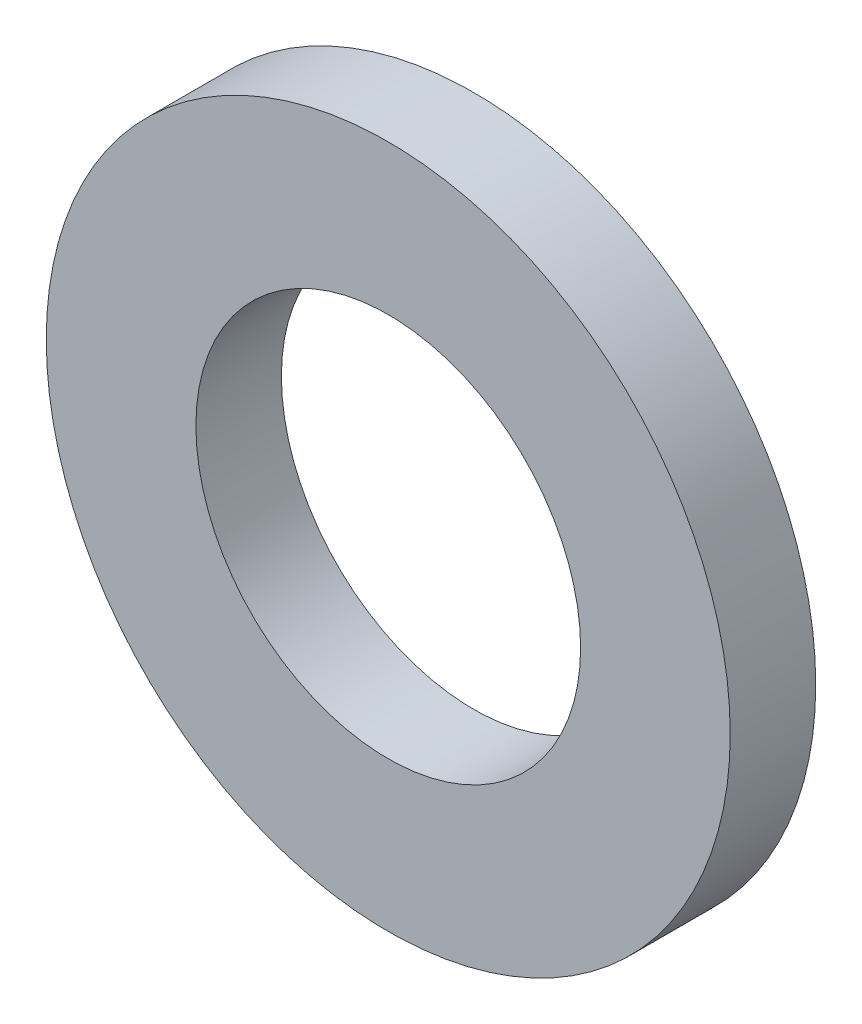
from build123d import *

# Parameters (mm, degrees)
ESQUISSE1_R          = 8
ESQUISSE1_R_2        = 4.5
BASE_EXTRUSION_DEPTH = 2


with BuildPart() as part:
    # Esquisse1 → Base-Extrusion (new body)
    with BuildSketch(Plane.XY):
        Circle(ESQUISSE1_R)
        Circle(ESQUISSE1_R_2, mode=Mode.SUBTRACT)
    extrude(amount=BASE_EXTRUSION_DEPTH)


solid = part.part
